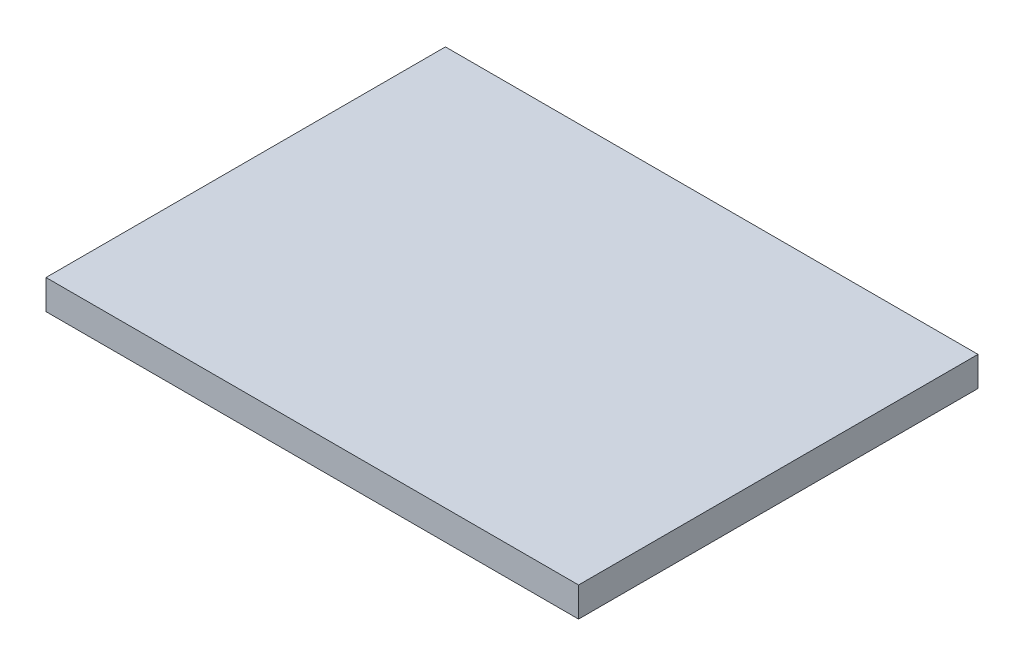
from build123d import *

# Parameters (mm, degrees)
ESQUISSE1_W      = 27
ESQUISSE1_H      = 36
EXTRUSION1_DEPTH = 2
EXTRUSION2_DEPTH = 3


with BuildPart() as part:
    # Esquisse1 → Extrusion1 (new body)
    with BuildSketch(Plane(origin=(0, 0, 0), x_dir=(0, 0, 1), z_dir=(0, -1, 0))):
        with Locations((13.5, 18)):
            Rectangle(ESQUISSE1_W, ESQUISSE1_H)
    extrude(amount=EXTRUSION1_DEPTH)

    # Esquisse2 → Extrusion2 (add)
    with BuildSketch(Plane(origin=(0, -2, 0), x_dir=(0, 0, -1), z_dir=(0, -1, 0))):
        with BuildLine():
            Line((-23.949489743, -6), (-19.050510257, -6))
            ThreePointArc((-19.050510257, -6), (-21.5, -3), (-23.949489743, -6))
        make_face()
        with BuildLine():
            Line((-7.949489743, -6), (-3.050510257, -6))
            ThreePointArc((-3.050510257, -6), (-5.5, -3), (-7.949489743, -6))
        make_face()
    extrude(amount=EXTRUSION2_DEPTH)


solid = part.part
